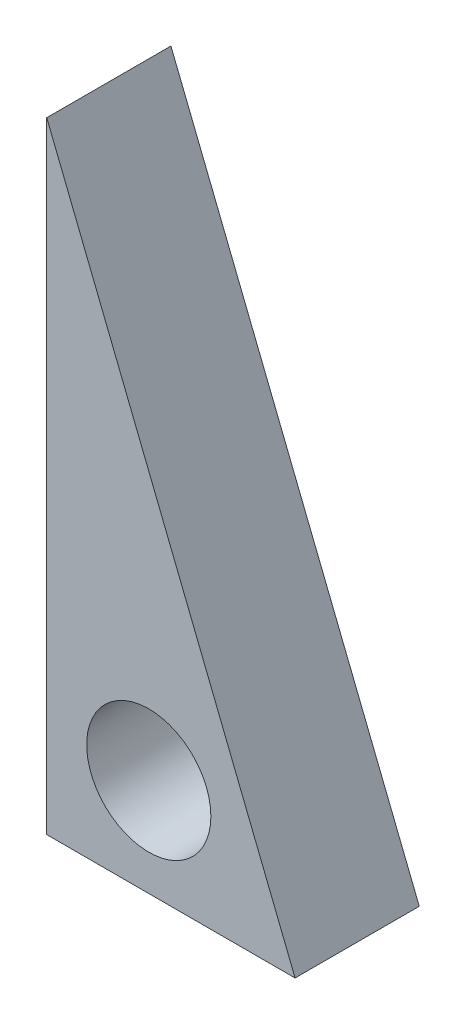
ISO-10303-21;
HEADER;
FILE_DESCRIPTION(('STEP AP214'),'2;1');
FILE_NAME('part.step','',(''),(''),'','','');
FILE_SCHEMA(('AUTOMOTIVE_DESIGN { 1 0 10303 214 1 1 1 1 }'));
ENDSEC;
DATA;
#1=APPLICATION_CONTEXT('core data for automotive mechanical design processes');
#2=APPLICATION_PROTOCOL_DEFINITION('international standard','automotive_design',2000,#1);
#3=PRODUCT_CONTEXT('',#1,'mechanical');
#4=PRODUCT('Part','Part','',(#3));
#5=PRODUCT_RELATED_PRODUCT_CATEGORY('part','',(#4));
#6=PRODUCT_DEFINITION_FORMATION('','',#4);
#7=PRODUCT_DEFINITION_CONTEXT('part definition',#1,'design');
#8=PRODUCT_DEFINITION('design','',#6,#7);
#9=PRODUCT_DEFINITION_SHAPE('','',#8);
#10=(LENGTH_UNIT() NAMED_UNIT(*) SI_UNIT(.MILLI.,.METRE.));
#11=(NAMED_UNIT(*) PLANE_ANGLE_UNIT() SI_UNIT($,.RADIAN.));
#12=(NAMED_UNIT(*) SI_UNIT($,.STERADIAN.) SOLID_ANGLE_UNIT());
#13=UNCERTAINTY_MEASURE_WITH_UNIT(LENGTH_MEASURE(1.E-05),#10,'distance_accuracy_value','');
#14=(GEOMETRIC_REPRESENTATION_CONTEXT(3) GLOBAL_UNCERTAINTY_ASSIGNED_CONTEXT((#13)) GLOBAL_UNIT_ASSIGNED_CONTEXT((#10,
#11,#12)) REPRESENTATION_CONTEXT('',''));
#15=CARTESIAN_POINT('',(0.,0.,0.));
#16=DIRECTION('',(0.,0.,1.));
#17=DIRECTION('',(1.,0.,0.));
#18=AXIS2_PLACEMENT_3D('',#15,#16,#17);
#19=CARTESIAN_POINT('',(0.,0.,1.));
#20=DIRECTION('',(1.,0.,0.));
#21=DIRECTION('',(0.,0.,-1.));
#22=AXIS2_PLACEMENT_3D('',#19,#20,#21);
#23=PLANE('',#22);
#24=DIRECTION('',(0.,-1.,0.));
#25=VECTOR('',#24,1.);
#26=CARTESIAN_POINT('',(0.,0.,0.));
#27=LINE('',#26,#25);
#28=CARTESIAN_POINT('',(0.,5.,0.));
#29=VERTEX_POINT('',#28);
#30=CARTESIAN_POINT('',(0.,0.,0.));
#31=VERTEX_POINT('',#30);
#32=EDGE_CURVE('E82',#29,#31,#27,.T.);
#33=ORIENTED_EDGE('',*,*,#32,.T.);
#34=DIRECTION('',(0.,0.,-1.));
#35=VECTOR('',#34,1.);
#36=CARTESIAN_POINT('',(0.,0.,1.));
#37=LINE('',#36,#35);
#38=CARTESIAN_POINT('',(0.,0.,1.));
#39=VERTEX_POINT('',#38);
#40=EDGE_CURVE('E11',#39,#31,#37,.T.);
#41=ORIENTED_EDGE('',*,*,#40,.F.);
#42=DIRECTION('',(0.,-1.,0.));
#43=VECTOR('',#42,1.);
#44=CARTESIAN_POINT('',(0.,0.,1.));
#45=LINE('',#44,#43);
#46=CARTESIAN_POINT('',(0.,5.,1.));
#47=VERTEX_POINT('',#46);
#48=EDGE_CURVE('E75',#47,#39,#45,.T.);
#49=ORIENTED_EDGE('',*,*,#48,.F.);
#50=DIRECTION('',(0.,0.,-1.));
#51=VECTOR('',#50,1.);
#52=CARTESIAN_POINT('',(0.,5.,1.));
#53=LINE('',#52,#51);
#54=EDGE_CURVE('E83',#47,#29,#53,.T.);
#55=ORIENTED_EDGE('',*,*,#54,.T.);
#56=EDGE_LOOP('',(#33,#41,#49,#55));
#57=FACE_BOUND('',#56,.T.);
#58=ADVANCED_FACE('F34',(#57),#23,.F.);
#59=CARTESIAN_POINT('',(0.,0.,1.));
#60=DIRECTION('',(0.,1.,0.));
#61=DIRECTION('',(0.,0.,1.));
#62=AXIS2_PLACEMENT_3D('',#59,#60,#61);
#63=PLANE('',#62);
#64=DIRECTION('',(1.,0.,0.));
#65=VECTOR('',#64,1.);
#66=CARTESIAN_POINT('',(0.,0.,0.));
#67=LINE('',#66,#65);
#68=CARTESIAN_POINT('',(2.,0.,0.));
#69=VERTEX_POINT('',#68);
#70=EDGE_CURVE('E63',#31,#69,#67,.T.);
#71=ORIENTED_EDGE('',*,*,#70,.T.);
#72=DIRECTION('',(0.,0.,-1.));
#73=VECTOR('',#72,1.);
#74=CARTESIAN_POINT('',(2.,0.,1.));
#75=LINE('',#74,#73);
#76=CARTESIAN_POINT('',(2.,0.,1.));
#77=VERTEX_POINT('',#76);
#78=EDGE_CURVE('E43',#77,#69,#75,.T.);
#79=ORIENTED_EDGE('',*,*,#78,.F.);
#80=DIRECTION('',(1.,0.,0.));
#81=VECTOR('',#80,1.);
#82=CARTESIAN_POINT('',(0.,0.,1.));
#83=LINE('',#82,#81);
#84=EDGE_CURVE('E71',#39,#77,#83,.T.);
#85=ORIENTED_EDGE('',*,*,#84,.F.);
#86=ORIENTED_EDGE('',*,*,#40,.T.);
#87=EDGE_LOOP('',(#71,#79,#85,#86));
#88=FACE_BOUND('',#87,.T.);
#89=ADVANCED_FACE('F72',(#88),#63,.F.);
#90=CARTESIAN_POINT('',(0.,5.,1.));
#91=DIRECTION('',(-0.928476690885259,-0.371390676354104,0.));
#92=DIRECTION('',(0.371390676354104,-0.928476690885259,0.));
#93=AXIS2_PLACEMENT_3D('',#90,#91,#92);
#94=PLANE('',#93);
#95=DIRECTION('',(-0.371390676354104,0.928476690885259,0.));
#96=VECTOR('',#95,1.);
#97=CARTESIAN_POINT('',(0.,5.,0.));
#98=LINE('',#97,#96);
#99=EDGE_CURVE('E68',#69,#29,#98,.T.);
#100=ORIENTED_EDGE('',*,*,#99,.T.);
#101=ORIENTED_EDGE('',*,*,#54,.F.);
#102=DIRECTION('',(-0.371390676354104,0.928476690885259,0.));
#103=VECTOR('',#102,1.);
#104=CARTESIAN_POINT('',(0.,5.,1.));
#105=LINE('',#104,#103);
#106=EDGE_CURVE('E51',#77,#47,#105,.T.);
#107=ORIENTED_EDGE('',*,*,#106,.F.);
#108=ORIENTED_EDGE('',*,*,#78,.T.);
#109=EDGE_LOOP('',(#100,#101,#107,#108));
#110=FACE_BOUND('',#109,.T.);
#111=ADVANCED_FACE('F93',(#110),#94,.F.);
#112=CARTESIAN_POINT('',(0.,0.,1.));
#113=DIRECTION('',(0.,0.,-1.));
#114=DIRECTION('',(-1.,0.,0.));
#115=AXIS2_PLACEMENT_3D('',#112,#113,#114);
#116=PLANE('',#115);
#117=CARTESIAN_POINT('',(0.821866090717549,0.78822431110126,1.));
#118=DIRECTION('',(0.,0.,1.));
#119=DIRECTION('',(1.,0.,0.));
#120=AXIS2_PLACEMENT_3D('',#117,#118,#119);
#121=CIRCLE('',#120,0.5);
#122=CARTESIAN_POINT('',(1.32186609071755,0.78822431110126,1.));
#123=VERTEX_POINT('',#122);
#124=EDGE_CURVE('E88',#123,#123,#121,.T.);
#125=ORIENTED_EDGE('',*,*,#124,.F.);
#126=EDGE_LOOP('',(#125));
#127=FACE_BOUND('',#126,.T.);
#128=ORIENTED_EDGE('',*,*,#48,.T.);
#129=ORIENTED_EDGE('',*,*,#84,.T.);
#130=ORIENTED_EDGE('',*,*,#106,.T.);
#131=EDGE_LOOP('',(#128,#129,#130));
#132=FACE_BOUND('',#131,.T.);
#133=ADVANCED_FACE('F78',(#127,#132),#116,.F.);
#134=CARTESIAN_POINT('',(0.,0.,0.));
#135=DIRECTION('',(0.,0.,-1.));
#136=DIRECTION('',(-1.,0.,0.));
#137=AXIS2_PLACEMENT_3D('',#134,#135,#136);
#138=PLANE('',#137);
#139=CARTESIAN_POINT('',(0.821866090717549,0.78822431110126,0.));
#140=DIRECTION('',(0.,0.,-1.));
#141=DIRECTION('',(-1.,0.,0.));
#142=AXIS2_PLACEMENT_3D('',#139,#140,#141);
#143=CIRCLE('',#142,0.5);
#144=CARTESIAN_POINT('',(0.321866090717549,0.78822431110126,0.));
#145=VERTEX_POINT('',#144);
#146=EDGE_CURVE('E37',#145,#145,#143,.T.);
#147=ORIENTED_EDGE('',*,*,#146,.F.);
#148=EDGE_LOOP('',(#147));
#149=FACE_BOUND('',#148,.T.);
#150=ORIENTED_EDGE('',*,*,#32,.F.);
#151=ORIENTED_EDGE('',*,*,#99,.F.);
#152=ORIENTED_EDGE('',*,*,#70,.F.);
#153=EDGE_LOOP('',(#150,#151,#152));
#154=FACE_BOUND('',#153,.T.);
#155=ADVANCED_FACE('F94',(#149,#154),#138,.T.);
#156=CARTESIAN_POINT('',(0.821866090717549,0.78822431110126,-9.));
#157=DIRECTION('',(0.,0.,1.));
#158=DIRECTION('',(1.,0.,0.));
#159=AXIS2_PLACEMENT_3D('',#156,#157,#158);
#160=CYLINDRICAL_SURFACE('',#159,0.5);
#161=ORIENTED_EDGE('',*,*,#146,.T.);
#162=EDGE_LOOP('',(#161));
#163=FACE_BOUND('',#162,.T.);
#164=ORIENTED_EDGE('',*,*,#124,.T.);
#165=EDGE_LOOP('',(#164));
#166=FACE_BOUND('',#165,.T.);
#167=ADVANCED_FACE('F96',(#163,#166),#160,.F.);
#168=CLOSED_SHELL('',(#58,#89,#111,#133,#155,#167));
#169=MANIFOLD_SOLID_BREP('B2',#168);
#170=ADVANCED_BREP_SHAPE_REPRESENTATION('',(#18,#169),#14);
#171=SHAPE_DEFINITION_REPRESENTATION(#9,#170);
ENDSEC;
END-ISO-10303-21;
